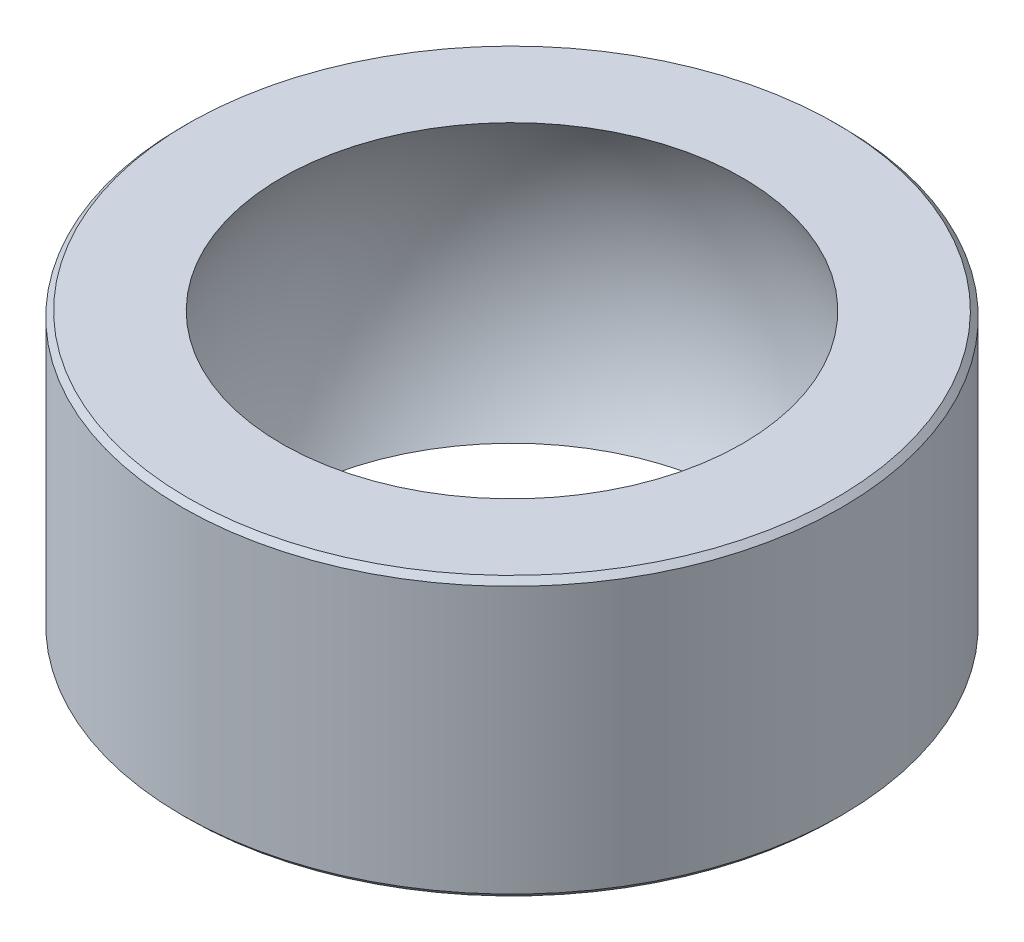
from build123d import *


with BuildPart() as part:
    # Sketch1 → Revolve1 (revolve)
    with BuildSketch(Plane.XY, mode=Mode.PRIVATE) as revolve1_sk:
        with BuildLine():
            Line((10.53775995, 6.35), (14.82725, 6.35))
            Line((14.82725, 6.35), (15.08125, 6.096))
            Line((15.08125, 6.096), (15.08125, -6.096))
            Line((15.08125, -6.096), (14.82725, -6.35))
            Line((14.82725, -6.35), (10.53775995, -6.35))
            ThreePointArc((10.53775995, -6.35), (12.303125, 0), (10.53775995, 6.35))
        make_face()
    revolve(revolve1_sk.sketch.rotate(Axis((0, 55, 0), (0, -1, 0)), 90), axis=Axis((0, 55, 0), (0, -1, 0)))


solid = part.part
